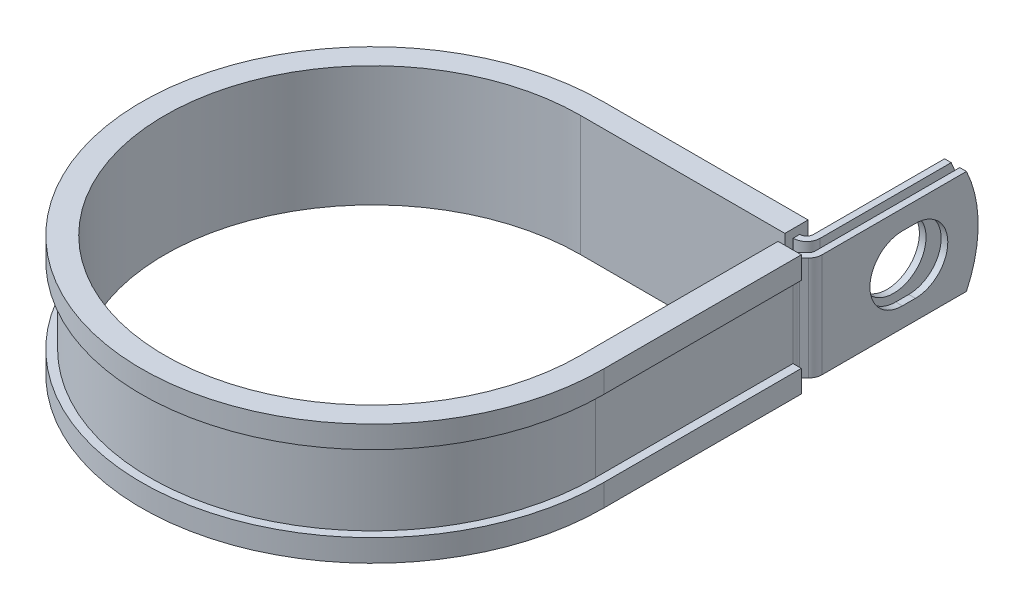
ISO-10303-21;
HEADER;
FILE_DESCRIPTION(('STEP AP214'),'2;1');
FILE_NAME('part.step','',(''),(''),'','','');
FILE_SCHEMA(('AUTOMOTIVE_DESIGN { 1 0 10303 214 1 1 1 1 }'));
ENDSEC;
DATA;
#1=APPLICATION_CONTEXT('core data for automotive mechanical design processes');
#2=APPLICATION_PROTOCOL_DEFINITION('international standard','automotive_design',2000,#1);
#3=PRODUCT_CONTEXT('',#1,'mechanical');
#4=PRODUCT('Part','Part','',(#3));
#5=PRODUCT_RELATED_PRODUCT_CATEGORY('part','',(#4));
#6=PRODUCT_DEFINITION_FORMATION('','',#4);
#7=PRODUCT_DEFINITION_CONTEXT('part definition',#1,'design');
#8=PRODUCT_DEFINITION('design','',#6,#7);
#9=PRODUCT_DEFINITION_SHAPE('','',#8);
#10=(LENGTH_UNIT() NAMED_UNIT(*) SI_UNIT(.MILLI.,.METRE.));
#11=(NAMED_UNIT(*) PLANE_ANGLE_UNIT() SI_UNIT($,.RADIAN.));
#12=(NAMED_UNIT(*) SI_UNIT($,.STERADIAN.) SOLID_ANGLE_UNIT());
#13=UNCERTAINTY_MEASURE_WITH_UNIT(LENGTH_MEASURE(1.E-05),#10,'distance_accuracy_value','');
#14=(GEOMETRIC_REPRESENTATION_CONTEXT(3) GLOBAL_UNCERTAINTY_ASSIGNED_CONTEXT((#13)) GLOBAL_UNIT_ASSIGNED_CONTEXT((#10,
#11,#12)) REPRESENTATION_CONTEXT('',''));
#15=CARTESIAN_POINT('',(0.,0.,0.));
#16=DIRECTION('',(0.,0.,1.));
#17=DIRECTION('',(1.,0.,0.));
#18=AXIS2_PLACEMENT_3D('',#15,#16,#17);
#19=CARTESIAN_POINT('',(40.3022698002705,-9.525,-39.624));
#20=DIRECTION('',(0.,1.,0.));
#21=DIRECTION('',(1.,0.,0.));
#22=AXIS2_PLACEMENT_3D('',#19,#20,#21);
#23=PLANE('',#22);
#24=DIRECTION('',(0.,0.,-1.));
#25=VECTOR('',#24,1.);
#26=CARTESIAN_POINT('',(37.457469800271,-9.525,-39.624));
#27=LINE('',#26,#25);
#28=CARTESIAN_POINT('',(37.457469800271,-9.525,-39.624));
#29=VERTEX_POINT('',#28);
#30=CARTESIAN_POINT('',(37.457469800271,-9.525,-40.8432));
#31=VERTEX_POINT('',#30);
#32=EDGE_CURVE('E524',#29,#31,#27,.T.);
#33=ORIENTED_EDGE('',*,*,#32,.T.);
#34=DIRECTION('',(1.,0.,0.));
#35=VECTOR('',#34,1.);
#36=CARTESIAN_POINT('',(0.,-9.525,-40.8432));
#37=LINE('',#36,#35);
#38=CARTESIAN_POINT('',(37.5082698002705,-9.525,-40.8432));
#39=VERTEX_POINT('',#38);
#40=EDGE_CURVE('E411',#39,#31,#37,.F.);
#41=ORIENTED_EDGE('',*,*,#40,.F.);
#42=CARTESIAN_POINT('',(37.5082698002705,-9.525,-42.0624));
#43=DIRECTION('',(0.,1.,0.));
#44=DIRECTION('',(1.,0.,0.));
#45=AXIS2_PLACEMENT_3D('',#42,#43,#44);
#46=CIRCLE('',#45,1.21919999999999);
#47=CARTESIAN_POINT('',(38.7274698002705,-9.525,-42.0624));
#48=VERTEX_POINT('',#47);
#49=EDGE_CURVE('E409',#48,#39,#46,.F.);
#50=ORIENTED_EDGE('',*,*,#49,.F.);
#51=DIRECTION('',(0.,0.,1.));
#52=VECTOR('',#51,1.);
#53=CARTESIAN_POINT('',(38.7274698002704,-9.525,-68.2498));
#54=LINE('',#53,#52);
#55=CARTESIAN_POINT('',(38.7274698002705,-9.525,-66.1052631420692));
#56=VERTEX_POINT('',#55);
#57=EDGE_CURVE('E407',#56,#48,#54,.T.);
#58=ORIENTED_EDGE('',*,*,#57,.F.);
#59=DIRECTION('',(-1.,0.,0.));
#60=VECTOR('',#59,1.);
#61=CARTESIAN_POINT('',(42.7406698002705,-9.525,-66.1052631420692));
#62=LINE('',#61,#60);
#63=CARTESIAN_POINT('',(39.9466698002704,-9.525,-66.1052631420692));
#64=VERTEX_POINT('',#63);
#65=EDGE_CURVE('E12',#64,#56,#62,.T.);
#66=ORIENTED_EDGE('',*,*,#65,.F.);
#67=DIRECTION('',(0.,0.,1.));
#68=VECTOR('',#67,1.);
#69=CARTESIAN_POINT('',(39.9466698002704,-9.525,-68.2498));
#70=LINE('',#69,#68);
#71=CARTESIAN_POINT('',(39.9466698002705,-9.525,-42.0624));
#72=VERTEX_POINT('',#71);
#73=EDGE_CURVE('E405',#64,#72,#70,.T.);
#74=ORIENTED_EDGE('',*,*,#73,.T.);
#75=CARTESIAN_POINT('',(37.5082698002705,-9.525,-42.0624));
#76=DIRECTION('',(0.,-1.,0.));
#77=DIRECTION('',(0.,0.,1.));
#78=AXIS2_PLACEMENT_3D('',#75,#76,#77);
#79=CIRCLE('',#78,2.43839999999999);
#80=CARTESIAN_POINT('',(37.5082698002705,-9.525,-39.624));
#81=VERTEX_POINT('',#80);
#82=EDGE_CURVE('E402',#72,#81,#79,.T.);
#83=ORIENTED_EDGE('',*,*,#82,.T.);
#84=DIRECTION('',(-1.,0.,0.));
#85=VECTOR('',#84,1.);
#86=CARTESIAN_POINT('',(0.,-9.525,-39.624));
#87=LINE('',#86,#85);
#88=EDGE_CURVE('E399',#81,#29,#87,.T.);
#89=ORIENTED_EDGE('',*,*,#88,.T.);
#90=EDGE_LOOP('',(#33,#41,#50,#58,#66,#74,#83,#89));
#91=FACE_BOUND('',#90,.T.);
#92=ADVANCED_FACE('F55',(#91),#23,.F.);
#93=CARTESIAN_POINT('',(40.3022698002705,9.525,-39.624));
#94=DIRECTION('',(0.,1.,0.));
#95=DIRECTION('',(1.,0.,0.));
#96=AXIS2_PLACEMENT_3D('',#93,#94,#95);
#97=PLANE('',#96);
#98=DIRECTION('',(1.,0.,0.));
#99=VECTOR('',#98,1.);
#100=CARTESIAN_POINT('',(0.,9.525,-40.8432));
#101=LINE('',#100,#99);
#102=CARTESIAN_POINT('',(37.5082698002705,9.525,-40.8432));
#103=VERTEX_POINT('',#102);
#104=CARTESIAN_POINT('',(37.457469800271,9.525,-40.8432));
#105=VERTEX_POINT('',#104);
#106=EDGE_CURVE('E369',#103,#105,#101,.F.);
#107=ORIENTED_EDGE('',*,*,#106,.T.);
#108=DIRECTION('',(0.,0.,1.));
#109=VECTOR('',#108,1.);
#110=CARTESIAN_POINT('',(37.457469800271,9.525,-40.8432));
#111=LINE('',#110,#109);
#112=CARTESIAN_POINT('',(37.457469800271,9.525,-39.624));
#113=VERTEX_POINT('',#112);
#114=EDGE_CURVE('E518',#105,#113,#111,.T.);
#115=ORIENTED_EDGE('',*,*,#114,.T.);
#116=DIRECTION('',(-1.,0.,0.));
#117=VECTOR('',#116,1.);
#118=CARTESIAN_POINT('',(0.,9.525,-39.624));
#119=LINE('',#118,#117);
#120=CARTESIAN_POINT('',(37.5082698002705,9.525,-39.624));
#121=VERTEX_POINT('',#120);
#122=EDGE_CURVE('E626',#121,#113,#119,.T.);
#123=ORIENTED_EDGE('',*,*,#122,.F.);
#124=CARTESIAN_POINT('',(37.5082698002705,9.525,-42.0624));
#125=DIRECTION('',(0.,-1.,0.));
#126=DIRECTION('',(0.,0.,1.));
#127=AXIS2_PLACEMENT_3D('',#124,#125,#126);
#128=CIRCLE('',#127,2.43839999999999);
#129=CARTESIAN_POINT('',(39.9466698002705,9.525,-42.0624));
#130=VERTEX_POINT('',#129);
#131=EDGE_CURVE('E371',#130,#121,#128,.T.);
#132=ORIENTED_EDGE('',*,*,#131,.F.);
#133=DIRECTION('',(0.,0.,1.));
#134=VECTOR('',#133,1.);
#135=CARTESIAN_POINT('',(39.9466698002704,9.525,-68.2498));
#136=LINE('',#135,#134);
#137=CARTESIAN_POINT('',(39.9466698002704,9.525,-66.1052631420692));
#138=VERTEX_POINT('',#137);
#139=EDGE_CURVE('E362',#138,#130,#136,.T.);
#140=ORIENTED_EDGE('',*,*,#139,.F.);
#141=DIRECTION('',(-1.,0.,0.));
#142=VECTOR('',#141,1.);
#143=CARTESIAN_POINT('',(42.7406698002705,9.525,-66.1052631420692));
#144=LINE('',#143,#142);
#145=CARTESIAN_POINT('',(38.7274698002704,9.525,-66.1052631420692));
#146=VERTEX_POINT('',#145);
#147=EDGE_CURVE('E63',#138,#146,#144,.T.);
#148=ORIENTED_EDGE('',*,*,#147,.T.);
#149=DIRECTION('',(0.,0.,1.));
#150=VECTOR('',#149,1.);
#151=CARTESIAN_POINT('',(38.7274698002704,9.525,-68.2498));
#152=LINE('',#151,#150);
#153=CARTESIAN_POINT('',(38.7274698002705,9.525,-42.0624));
#154=VERTEX_POINT('',#153);
#155=EDGE_CURVE('E359',#146,#154,#152,.T.);
#156=ORIENTED_EDGE('',*,*,#155,.T.);
#157=CARTESIAN_POINT('',(37.5082698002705,9.525,-42.0624));
#158=DIRECTION('',(0.,1.,0.));
#159=DIRECTION('',(1.,0.,0.));
#160=AXIS2_PLACEMENT_3D('',#157,#158,#159);
#161=CIRCLE('',#160,1.21919999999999);
#162=EDGE_CURVE('E367',#154,#103,#161,.F.);
#163=ORIENTED_EDGE('',*,*,#162,.T.);
#164=EDGE_LOOP('',(#107,#115,#123,#132,#140,#148,#156,#163));
#165=FACE_BOUND('',#164,.T.);
#166=ADVANCED_FACE('F358',(#165),#97,.T.);
#167=CARTESIAN_POINT('',(0.,9.525,-39.624));
#168=DIRECTION('',(0.,0.,1.));
#169=DIRECTION('',(1.,0.,0.));
#170=AXIS2_PLACEMENT_3D('',#167,#168,#169);
#171=PLANE('',#170);
#172=ORIENTED_EDGE('',*,*,#122,.T.);
#173=DIRECTION('',(0.,-1.,0.));
#174=VECTOR('',#173,1.);
#175=CARTESIAN_POINT('',(37.457469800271,9.525,-39.624));
#176=LINE('',#175,#174);
#177=EDGE_CURVE('E521',#113,#29,#176,.T.);
#178=ORIENTED_EDGE('',*,*,#177,.T.);
#179=ORIENTED_EDGE('',*,*,#88,.F.);
#180=DIRECTION('',(0.,-1.,0.));
#181=VECTOR('',#180,1.);
#182=CARTESIAN_POINT('',(37.5082698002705,9.525,-39.624));
#183=LINE('',#182,#181);
#184=EDGE_CURVE('E345',#121,#81,#183,.T.);
#185=ORIENTED_EDGE('',*,*,#184,.F.);
#186=EDGE_LOOP('',(#172,#178,#179,#185));
#187=FACE_BOUND('',#186,.T.);
#188=ADVANCED_FACE('F636',(#187),#171,.T.);
#189=CARTESIAN_POINT('',(42.7406698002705,9.525,-39.624));
#190=DIRECTION('',(-1.,0.,0.));
#191=DIRECTION('',(0.,0.,1.));
#192=AXIS2_PLACEMENT_3D('',#189,#190,#191);
#193=PLANE('',#192);
#194=CARTESIAN_POINT('',(42.7406698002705,0.,-56.7435999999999));
#195=DIRECTION('',(1.,0.,0.));
#196=DIRECTION('',(0.,0.,-1.));
#197=AXIS2_PLACEMENT_3D('',#194,#195,#196);
#198=CIRCLE('',#197,5.9436);
#199=CARTESIAN_POINT('',(42.7406698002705,-5.9436,-56.7436000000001));
#200=VERTEX_POINT('',#199);
#201=CARTESIAN_POINT('',(42.7406698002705,5.9436,-56.7436000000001));
#202=VERTEX_POINT('',#201);
#203=EDGE_CURVE('E581',#200,#202,#198,.T.);
#204=ORIENTED_EDGE('',*,*,#203,.F.);
#205=DIRECTION('',(0.,0.,-1.));
#206=VECTOR('',#205,1.);
#207=CARTESIAN_POINT('',(42.7406698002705,-5.9436,-54.3559999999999));
#208=LINE('',#207,#206);
#209=CARTESIAN_POINT('',(42.7406698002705,-5.9436,-54.3559999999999));
#210=VERTEX_POINT('',#209);
#211=EDGE_CURVE('E584',#210,#200,#208,.T.);
#212=ORIENTED_EDGE('',*,*,#211,.F.);
#213=CARTESIAN_POINT('',(42.7406698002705,0.,-54.3559999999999));
#214=DIRECTION('',(1.,0.,0.));
#215=DIRECTION('',(0.,0.,-1.));
#216=AXIS2_PLACEMENT_3D('',#213,#214,#215);
#217=CIRCLE('',#216,5.9436);
#218=CARTESIAN_POINT('',(42.7406698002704,5.9436,-54.3559999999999));
#219=VERTEX_POINT('',#218);
#220=EDGE_CURVE('E577',#219,#210,#217,.T.);
#221=ORIENTED_EDGE('',*,*,#220,.F.);
#222=DIRECTION('',(0.,0.,1.));
#223=VECTOR('',#222,1.);
#224=CARTESIAN_POINT('',(42.7406698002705,5.9436,-54.3559999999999));
#225=LINE('',#224,#223);
#226=EDGE_CURVE('E578',#202,#219,#225,.T.);
#227=ORIENTED_EDGE('',*,*,#226,.F.);
#228=EDGE_LOOP('',(#204,#212,#221,#227));
#229=FACE_BOUND('',#228,.T.);
#230=DIRECTION('',(0.,0.,-1.));
#231=VECTOR('',#230,1.);
#232=CARTESIAN_POINT('',(42.7406698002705,-9.525,-39.624));
#233=LINE('',#232,#231);
#234=CARTESIAN_POINT('',(42.7406698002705,-9.525,-39.624));
#235=VERTEX_POINT('',#234);
#236=CARTESIAN_POINT('',(42.7406698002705,-9.525,-66.1052631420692));
#237=VERTEX_POINT('',#236);
#238=EDGE_CURVE('E383',#235,#237,#233,.T.);
#239=ORIENTED_EDGE('',*,*,#238,.T.);
#240=CARTESIAN_POINT('',(42.7406698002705,0.,-46.0248));
#241=DIRECTION('',(-1.,0.,0.));
#242=DIRECTION('',(0.,0.,1.));
#243=AXIS2_PLACEMENT_3D('',#240,#241,#242);
#244=CIRCLE('',#243,22.225);
#245=CARTESIAN_POINT('',(42.7406698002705,9.525,-66.1052631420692));
#246=VERTEX_POINT('',#245);
#247=EDGE_CURVE('E569',#246,#237,#244,.T.);
#248=ORIENTED_EDGE('',*,*,#247,.F.);
#249=DIRECTION('',(0.,0.,-1.));
#250=VECTOR('',#249,1.);
#251=CARTESIAN_POINT('',(42.7406698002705,9.525,-39.624));
#252=LINE('',#251,#250);
#253=CARTESIAN_POINT('',(42.7406698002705,9.525,-39.624));
#254=VERTEX_POINT('',#253);
#255=EDGE_CURVE('E420',#254,#246,#252,.T.);
#256=ORIENTED_EDGE('',*,*,#255,.F.);
#257=DIRECTION('',(0.,-1.,0.));
#258=VECTOR('',#257,1.);
#259=CARTESIAN_POINT('',(42.7406698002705,9.525,-39.624));
#260=LINE('',#259,#258);
#261=EDGE_CURVE('E382',#254,#235,#260,.T.);
#262=ORIENTED_EDGE('',*,*,#261,.T.);
#263=EDGE_LOOP('',(#239,#248,#256,#262));
#264=FACE_BOUND('',#263,.T.);
#265=ADVANCED_FACE('F57',(#229,#264),#193,.F.);
#266=CARTESIAN_POINT('',(41.5214698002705,9.525,-39.624));
#267=DIRECTION('',(-1.,0.,0.));
#268=DIRECTION('',(0.,0.,1.));
#269=AXIS2_PLACEMENT_3D('',#266,#267,#268);
#270=PLANE('',#269);
#271=DIRECTION('',(0.,0.,-1.));
#272=VECTOR('',#271,1.);
#273=CARTESIAN_POINT('',(41.5214698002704,-5.9436,-54.3559999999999));
#274=LINE('',#273,#272);
#275=CARTESIAN_POINT('',(41.5214698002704,-5.9436,-54.3559999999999));
#276=VERTEX_POINT('',#275);
#277=CARTESIAN_POINT('',(41.5214698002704,-5.9436,-56.7436000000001));
#278=VERTEX_POINT('',#277);
#279=EDGE_CURVE('E580',#276,#278,#274,.T.);
#280=ORIENTED_EDGE('',*,*,#279,.T.);
#281=CARTESIAN_POINT('',(41.5214698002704,0.,-56.7435999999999));
#282=DIRECTION('',(-1.,0.,0.));
#283=DIRECTION('',(0.,0.,1.));
#284=AXIS2_PLACEMENT_3D('',#281,#282,#283);
#285=CIRCLE('',#284,5.9436);
#286=CARTESIAN_POINT('',(41.5214698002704,5.9436,-56.7436000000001));
#287=VERTEX_POINT('',#286);
#288=EDGE_CURVE('E601',#278,#287,#285,.F.);
#289=ORIENTED_EDGE('',*,*,#288,.T.);
#290=DIRECTION('',(0.,0.,1.));
#291=VECTOR('',#290,1.);
#292=CARTESIAN_POINT('',(41.5214698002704,5.9436,-54.3559999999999));
#293=LINE('',#292,#291);
#294=CARTESIAN_POINT('',(41.5214698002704,5.9436,-54.3559999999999));
#295=VERTEX_POINT('',#294);
#296=EDGE_CURVE('E597',#287,#295,#293,.T.);
#297=ORIENTED_EDGE('',*,*,#296,.T.);
#298=CARTESIAN_POINT('',(41.5214698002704,0.,-54.3559999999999));
#299=DIRECTION('',(-1.,0.,0.));
#300=DIRECTION('',(0.,0.,1.));
#301=AXIS2_PLACEMENT_3D('',#298,#299,#300);
#302=CIRCLE('',#301,5.9436);
#303=EDGE_CURVE('E592',#295,#276,#302,.F.);
#304=ORIENTED_EDGE('',*,*,#303,.T.);
#305=EDGE_LOOP('',(#280,#289,#297,#304));
#306=FACE_BOUND('',#305,.T.);
#307=CARTESIAN_POINT('',(41.5214698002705,0.,-46.0248));
#308=DIRECTION('',(-1.,0.,0.));
#309=DIRECTION('',(0.,0.,1.));
#310=AXIS2_PLACEMENT_3D('',#307,#308,#309);
#311=CIRCLE('',#310,22.225);
#312=CARTESIAN_POINT('',(41.5214698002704,9.525,-66.1052631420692));
#313=VERTEX_POINT('',#312);
#314=CARTESIAN_POINT('',(41.5214698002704,-9.525,-66.1052631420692));
#315=VERTEX_POINT('',#314);
#316=EDGE_CURVE('E77',#313,#315,#311,.T.);
#317=ORIENTED_EDGE('',*,*,#316,.T.);
#318=DIRECTION('',(0.,0.,-1.));
#319=VECTOR('',#318,1.);
#320=CARTESIAN_POINT('',(41.5214698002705,-9.525,-39.624));
#321=LINE('',#320,#319);
#322=CARTESIAN_POINT('',(41.5214698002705,-9.525,-39.624));
#323=VERTEX_POINT('',#322);
#324=EDGE_CURVE('E386',#323,#315,#321,.T.);
#325=ORIENTED_EDGE('',*,*,#324,.F.);
#326=DIRECTION('',(0.,-1.,0.));
#327=VECTOR('',#326,1.);
#328=CARTESIAN_POINT('',(41.5214698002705,9.525,-39.624));
#329=LINE('',#328,#327);
#330=CARTESIAN_POINT('',(41.5214698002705,9.525,-39.624));
#331=VERTEX_POINT('',#330);
#332=EDGE_CURVE('E353',#331,#323,#329,.T.);
#333=ORIENTED_EDGE('',*,*,#332,.F.);
#334=DIRECTION('',(0.,0.,-1.));
#335=VECTOR('',#334,1.);
#336=CARTESIAN_POINT('',(41.5214698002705,9.525,-39.624));
#337=LINE('',#336,#335);
#338=EDGE_CURVE('E616',#331,#313,#337,.T.);
#339=ORIENTED_EDGE('',*,*,#338,.T.);
#340=EDGE_LOOP('',(#317,#325,#333,#339));
#341=FACE_BOUND('',#340,.T.);
#342=ADVANCED_FACE('F690',(#306,#341),#270,.T.);
#343=CARTESIAN_POINT('',(39.9466698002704,9.525,-68.2498));
#344=DIRECTION('',(1.,0.,0.));
#345=DIRECTION('',(0.,0.,-1.));
#346=AXIS2_PLACEMENT_3D('',#343,#344,#345);
#347=PLANE('',#346);
#348=CARTESIAN_POINT('',(39.9466698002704,0.,-55.5498));
#349=DIRECTION('',(1.,0.,0.));
#350=DIRECTION('',(0.,0.,-1.));
#351=AXIS2_PLACEMENT_3D('',#348,#349,#350);
#352=CIRCLE('',#351,5.9436);
#353=CARTESIAN_POINT('',(39.9466698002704,0.,-61.4934));
#354=VERTEX_POINT('',#353);
#355=EDGE_CURVE('E387',#354,#354,#352,.F.);
#356=ORIENTED_EDGE('',*,*,#355,.T.);
#357=EDGE_LOOP('',(#356));
#358=FACE_BOUND('',#357,.T.);
#359=ORIENTED_EDGE('',*,*,#73,.F.);
#360=CARTESIAN_POINT('',(39.9466698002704,0.,-46.0248));
#361=DIRECTION('',(1.,0.,0.));
#362=DIRECTION('',(0.,0.,-1.));
#363=AXIS2_PLACEMENT_3D('',#360,#361,#362);
#364=CIRCLE('',#363,22.225);
#365=EDGE_CURVE('E574',#64,#138,#364,.T.);
#366=ORIENTED_EDGE('',*,*,#365,.T.);
#367=ORIENTED_EDGE('',*,*,#139,.T.);
#368=DIRECTION('',(0.,-1.,0.));
#369=VECTOR('',#368,1.);
#370=CARTESIAN_POINT('',(39.9466698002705,9.525,-42.0624));
#371=LINE('',#370,#369);
#372=EDGE_CURVE('E342',#130,#72,#371,.T.);
#373=ORIENTED_EDGE('',*,*,#372,.T.);
#374=EDGE_LOOP('',(#359,#366,#367,#373));
#375=FACE_BOUND('',#374,.T.);
#376=ADVANCED_FACE('F642',(#358,#375),#347,.T.);
#377=CARTESIAN_POINT('',(38.7274698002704,9.525,-68.2498));
#378=DIRECTION('',(1.,0.,0.));
#379=DIRECTION('',(0.,0.,-1.));
#380=AXIS2_PLACEMENT_3D('',#377,#378,#379);
#381=PLANE('',#380);
#382=CARTESIAN_POINT('',(38.7274698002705,0.,-55.5498));
#383=DIRECTION('',(-1.,0.,0.));
#384=DIRECTION('',(0.,0.,1.));
#385=AXIS2_PLACEMENT_3D('',#382,#383,#384);
#386=CIRCLE('',#385,5.9436);
#387=CARTESIAN_POINT('',(38.7274698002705,0.,-49.6062));
#388=VERTEX_POINT('',#387);
#389=EDGE_CURVE('E609',#388,#388,#386,.T.);
#390=ORIENTED_EDGE('',*,*,#389,.F.);
#391=EDGE_LOOP('',(#390));
#392=FACE_BOUND('',#391,.T.);
#393=CARTESIAN_POINT('',(38.7274698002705,0.,-46.0248));
#394=DIRECTION('',(-1.,0.,0.));
#395=DIRECTION('',(0.,0.,1.));
#396=AXIS2_PLACEMENT_3D('',#393,#394,#395);
#397=CIRCLE('',#396,22.225);
#398=EDGE_CURVE('E69',#146,#56,#397,.T.);
#399=ORIENTED_EDGE('',*,*,#398,.T.);
#400=ORIENTED_EDGE('',*,*,#57,.T.);
#401=DIRECTION('',(0.,-1.,0.));
#402=VECTOR('',#401,1.);
#403=CARTESIAN_POINT('',(38.7274698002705,9.525,-42.0624));
#404=LINE('',#403,#402);
#405=EDGE_CURVE('E339',#154,#48,#404,.T.);
#406=ORIENTED_EDGE('',*,*,#405,.F.);
#407=ORIENTED_EDGE('',*,*,#155,.F.);
#408=EDGE_LOOP('',(#399,#400,#406,#407));
#409=FACE_BOUND('',#408,.T.);
#410=ADVANCED_FACE('F365',(#392,#409),#381,.F.);
#411=CARTESIAN_POINT('',(42.0624,-9.525,-36.2115026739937));
#412=DIRECTION('',(0.,1.,0.));
#413=DIRECTION('',(1.,0.,0.));
#414=AXIS2_PLACEMENT_3D('',#411,#412,#413);
#415=CIRCLE('',#414,1.2192);
#416=CARTESIAN_POINT('',(40.8432,-9.525,-36.2115026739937));
#417=VERTEX_POINT('',#416);
#418=CARTESIAN_POINT('',(41.2002954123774,-9.525,-37.0736072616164));
#419=VERTEX_POINT('',#418);
#420=EDGE_CURVE('E414',#417,#419,#415,.F.);
#421=ORIENTED_EDGE('',*,*,#420,.F.);
#422=DIRECTION('',(1.,0.,0.));
#423=VECTOR('',#422,1.);
#424=CARTESIAN_POINT('',(39.624,-9.525,-36.2115026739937));
#425=LINE('',#424,#423);
#426=CARTESIAN_POINT('',(39.624,-9.525,-36.2115026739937));
#427=VERTEX_POINT('',#426);
#428=EDGE_CURVE('E452',#427,#417,#425,.T.);
#429=ORIENTED_EDGE('',*,*,#428,.F.);
#430=CARTESIAN_POINT('',(42.0624,-9.525,-36.2115026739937));
#431=DIRECTION('',(0.,-1.,0.));
#432=DIRECTION('',(0.,0.,1.));
#433=AXIS2_PLACEMENT_3D('',#430,#431,#432);
#434=CIRCLE('',#433,2.4384);
#435=CARTESIAN_POINT('',(40.3381908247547,-9.525,-37.935711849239));
#436=VERTEX_POINT('',#435);
#437=EDGE_CURVE('E396',#427,#436,#434,.T.);
#438=ORIENTED_EDGE('',*,*,#437,.T.);
#439=DIRECTION('',(0.707106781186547,0.,-0.707106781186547));
#440=VECTOR('',#439,1.);
#441=CARTESIAN_POINT('',(40.3381908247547,-9.525,-37.935711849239));
#442=LINE('',#441,#440);
#443=CARTESIAN_POINT('',(41.1643743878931,-9.525,-38.7618954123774));
#444=VERTEX_POINT('',#443);
#445=EDGE_CURVE('E393',#436,#444,#442,.T.);
#446=ORIENTED_EDGE('',*,*,#445,.T.);
#447=CARTESIAN_POINT('',(40.3022698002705,-9.525,-39.624));
#448=DIRECTION('',(0.,1.,0.));
#449=DIRECTION('',(0.,0.,1.));
#450=AXIS2_PLACEMENT_3D('',#447,#448,#449);
#451=CIRCLE('',#450,1.2192);
#452=EDGE_CURVE('E390',#444,#323,#451,.T.);
#453=ORIENTED_EDGE('',*,*,#452,.T.);
#454=ORIENTED_EDGE('',*,*,#324,.T.);
#455=DIRECTION('',(-1.,0.,0.));
#456=VECTOR('',#455,1.);
#457=CARTESIAN_POINT('',(42.7406698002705,-9.525,-66.1052631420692));
#458=LINE('',#457,#456);
#459=EDGE_CURVE('E567',#237,#315,#458,.T.);
#460=ORIENTED_EDGE('',*,*,#459,.F.);
#461=ORIENTED_EDGE('',*,*,#238,.F.);
#462=CARTESIAN_POINT('',(40.3022698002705,-9.525,-39.624));
#463=DIRECTION('',(0.,1.,0.));
#464=DIRECTION('',(1.,0.,0.));
#465=AXIS2_PLACEMENT_3D('',#462,#463,#464);
#466=CIRCLE('',#465,2.4384);
#467=CARTESIAN_POINT('',(42.0264789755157,-9.525,-37.8997908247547));
#468=VERTEX_POINT('',#467);
#469=EDGE_CURVE('E418',#468,#235,#466,.T.);
#470=ORIENTED_EDGE('',*,*,#469,.F.);
#471=DIRECTION('',(0.707106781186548,0.,-0.707106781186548));
#472=VECTOR('',#471,1.);
#473=CARTESIAN_POINT('',(41.2002954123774,-9.525,-37.0736072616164));
#474=LINE('',#473,#472);
#475=EDGE_CURVE('E416',#419,#468,#474,.T.);
#476=ORIENTED_EDGE('',*,*,#475,.F.);
#477=EDGE_LOOP('',(#421,#429,#438,#446,#453,#454,#460,#461,#470,#476));
#478=FACE_BOUND('',#477,.T.);
#479=ADVANCED_FACE('F676',(#478),#23,.F.);
#480=DIRECTION('',(-1.,0.,0.));
#481=VECTOR('',#480,1.);
#482=CARTESIAN_POINT('',(40.8432,9.525,-36.2115026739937));
#483=LINE('',#482,#481);
#484=CARTESIAN_POINT('',(40.8432,9.525,-36.2115026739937));
#485=VERTEX_POINT('',#484);
#486=CARTESIAN_POINT('',(39.624,9.525,-36.2115026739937));
#487=VERTEX_POINT('',#486);
#488=EDGE_CURVE('E441',#485,#487,#483,.T.);
#489=ORIENTED_EDGE('',*,*,#488,.F.);
#490=CARTESIAN_POINT('',(42.0624,9.525,-36.2115026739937));
#491=DIRECTION('',(0.,1.,0.));
#492=DIRECTION('',(1.,0.,0.));
#493=AXIS2_PLACEMENT_3D('',#490,#491,#492);
#494=CIRCLE('',#493,1.2192);
#495=CARTESIAN_POINT('',(41.2002954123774,9.525,-37.0736072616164));
#496=VERTEX_POINT('',#495);
#497=EDGE_CURVE('E376',#485,#496,#494,.F.);
#498=ORIENTED_EDGE('',*,*,#497,.T.);
#499=DIRECTION('',(0.707106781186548,0.,-0.707106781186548));
#500=VECTOR('',#499,1.);
#501=CARTESIAN_POINT('',(41.2002954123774,9.525,-37.0736072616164));
#502=LINE('',#501,#500);
#503=CARTESIAN_POINT('',(42.0264789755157,9.525,-37.8997908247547));
#504=VERTEX_POINT('',#503);
#505=EDGE_CURVE('E378',#496,#504,#502,.T.);
#506=ORIENTED_EDGE('',*,*,#505,.T.);
#507=CARTESIAN_POINT('',(40.3022698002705,9.525,-39.624));
#508=DIRECTION('',(0.,1.,0.));
#509=DIRECTION('',(1.,0.,0.));
#510=AXIS2_PLACEMENT_3D('',#507,#508,#509);
#511=CIRCLE('',#510,2.4384);
#512=EDGE_CURVE('E380',#504,#254,#511,.T.);
#513=ORIENTED_EDGE('',*,*,#512,.T.);
#514=ORIENTED_EDGE('',*,*,#255,.T.);
#515=DIRECTION('',(-1.,0.,0.));
#516=VECTOR('',#515,1.);
#517=CARTESIAN_POINT('',(42.7406698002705,9.525,-66.1052631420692));
#518=LINE('',#517,#516);
#519=EDGE_CURVE('E571',#246,#313,#518,.T.);
#520=ORIENTED_EDGE('',*,*,#519,.T.);
#521=ORIENTED_EDGE('',*,*,#338,.F.);
#522=CARTESIAN_POINT('',(40.3022698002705,9.525,-39.624));
#523=DIRECTION('',(0.,1.,0.));
#524=DIRECTION('',(0.,0.,1.));
#525=AXIS2_PLACEMENT_3D('',#522,#523,#524);
#526=CIRCLE('',#525,1.2192);
#527=CARTESIAN_POINT('',(41.1643743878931,9.525,-38.7618954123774));
#528=VERTEX_POINT('',#527);
#529=EDGE_CURVE('E619',#528,#331,#526,.T.);
#530=ORIENTED_EDGE('',*,*,#529,.F.);
#531=DIRECTION('',(0.707106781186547,0.,-0.707106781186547));
#532=VECTOR('',#531,1.);
#533=CARTESIAN_POINT('',(40.3381908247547,9.525,-37.935711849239));
#534=LINE('',#533,#532);
#535=CARTESIAN_POINT('',(40.3381908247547,9.525,-37.935711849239));
#536=VERTEX_POINT('',#535);
#537=EDGE_CURVE('E622',#536,#528,#534,.T.);
#538=ORIENTED_EDGE('',*,*,#537,.F.);
#539=CARTESIAN_POINT('',(42.0624,9.525,-36.2115026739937));
#540=DIRECTION('',(0.,-1.,0.));
#541=DIRECTION('',(0.,0.,1.));
#542=AXIS2_PLACEMENT_3D('',#539,#540,#541);
#543=CIRCLE('',#542,2.4384);
#544=EDGE_CURVE('E451',#487,#536,#543,.T.);
#545=ORIENTED_EDGE('',*,*,#544,.F.);
#546=EDGE_LOOP('',(#489,#498,#506,#513,#514,#520,#521,#530,#538,#545));
#547=FACE_BOUND('',#546,.T.);
#548=ADVANCED_FACE('F448',(#547),#97,.T.);
#549=CARTESIAN_POINT('',(40.3022698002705,9.525,-39.624));
#550=DIRECTION('',(0.,-1.,0.));
#551=DIRECTION('',(0.,0.,-1.));
#552=AXIS2_PLACEMENT_3D('',#549,#550,#551);
#553=CYLINDRICAL_SURFACE('',#552,1.2192);
#554=ORIENTED_EDGE('',*,*,#452,.F.);
#555=DIRECTION('',(0.,-1.,0.));
#556=VECTOR('',#555,1.);
#557=CARTESIAN_POINT('',(41.1643743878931,9.525,-38.7618954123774));
#558=LINE('',#557,#556);
#559=EDGE_CURVE('E351',#528,#444,#558,.T.);
#560=ORIENTED_EDGE('',*,*,#559,.F.);
#561=ORIENTED_EDGE('',*,*,#529,.T.);
#562=ORIENTED_EDGE('',*,*,#332,.T.);
#563=EDGE_LOOP('',(#554,#560,#561,#562));
#564=FACE_BOUND('',#563,.T.);
#565=ADVANCED_FACE('F686',(#564),#553,.F.);
#566=CARTESIAN_POINT('',(40.3381908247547,9.525,-37.935711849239));
#567=DIRECTION('',(-0.707106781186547,0.,-0.707106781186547));
#568=DIRECTION('',(-0.707106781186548,0.,0.707106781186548));
#569=AXIS2_PLACEMENT_3D('',#566,#567,#568);
#570=PLANE('',#569);
#571=ORIENTED_EDGE('',*,*,#445,.F.);
#572=DIRECTION('',(0.,-1.,0.));
#573=VECTOR('',#572,1.);
#574=CARTESIAN_POINT('',(40.3381908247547,9.525,-37.935711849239));
#575=LINE('',#574,#573);
#576=EDGE_CURVE('E349',#536,#436,#575,.T.);
#577=ORIENTED_EDGE('',*,*,#576,.F.);
#578=ORIENTED_EDGE('',*,*,#537,.T.);
#579=ORIENTED_EDGE('',*,*,#559,.T.);
#580=EDGE_LOOP('',(#571,#577,#578,#579));
#581=FACE_BOUND('',#580,.T.);
#582=ADVANCED_FACE('F681',(#581),#570,.T.);
#583=CARTESIAN_POINT('',(42.0624,9.525,-36.2115026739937));
#584=DIRECTION('',(0.,-1.,0.));
#585=DIRECTION('',(0.,0.,-1.));
#586=AXIS2_PLACEMENT_3D('',#583,#584,#585);
#587=CYLINDRICAL_SURFACE('',#586,2.4384);
#588=ORIENTED_EDGE('',*,*,#437,.F.);
#589=DIRECTION('',(0.,-1.,0.));
#590=VECTOR('',#589,1.);
#591=CARTESIAN_POINT('',(39.624,9.525,-36.2115026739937));
#592=LINE('',#591,#590);
#593=EDGE_CURVE('E347',#487,#427,#592,.T.);
#594=ORIENTED_EDGE('',*,*,#593,.F.);
#595=ORIENTED_EDGE('',*,*,#544,.T.);
#596=ORIENTED_EDGE('',*,*,#576,.T.);
#597=EDGE_LOOP('',(#588,#594,#595,#596));
#598=FACE_BOUND('',#597,.T.);
#599=ADVANCED_FACE('F678',(#598),#587,.T.);
#600=CARTESIAN_POINT('',(37.5082698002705,9.525,-42.0624));
#601=DIRECTION('',(0.,-1.,0.));
#602=DIRECTION('',(0.,0.,-1.));
#603=AXIS2_PLACEMENT_3D('',#600,#601,#602);
#604=CYLINDRICAL_SURFACE('',#603,2.43839999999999);
#605=ORIENTED_EDGE('',*,*,#82,.F.);
#606=ORIENTED_EDGE('',*,*,#372,.F.);
#607=ORIENTED_EDGE('',*,*,#131,.T.);
#608=ORIENTED_EDGE('',*,*,#184,.T.);
#609=EDGE_LOOP('',(#605,#606,#607,#608));
#610=FACE_BOUND('',#609,.T.);
#611=ADVANCED_FACE('F632',(#610),#604,.T.);
#612=CARTESIAN_POINT('',(37.5082698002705,9.525,-42.0624));
#613=DIRECTION('',(0.,-1.,0.));
#614=DIRECTION('',(0.,0.,-1.));
#615=AXIS2_PLACEMENT_3D('',#612,#613,#614);
#616=CYLINDRICAL_SURFACE('',#615,1.21919999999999);
#617=ORIENTED_EDGE('',*,*,#49,.T.);
#618=DIRECTION('',(0.,-1.,0.));
#619=VECTOR('',#618,1.);
#620=CARTESIAN_POINT('',(37.5082698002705,9.525,-40.8432));
#621=LINE('',#620,#619);
#622=EDGE_CURVE('E330',#103,#39,#621,.T.);
#623=ORIENTED_EDGE('',*,*,#622,.F.);
#624=ORIENTED_EDGE('',*,*,#162,.F.);
#625=ORIENTED_EDGE('',*,*,#405,.T.);
#626=EDGE_LOOP('',(#617,#623,#624,#625));
#627=FACE_BOUND('',#626,.T.);
#628=ADVANCED_FACE('F647',(#627),#616,.F.);
#629=CARTESIAN_POINT('',(0.,9.525,-40.8432));
#630=DIRECTION('',(0.,0.,1.));
#631=DIRECTION('',(1.,0.,0.));
#632=AXIS2_PLACEMENT_3D('',#629,#630,#631);
#633=PLANE('',#632);
#634=DIRECTION('',(0.,-1.,0.));
#635=VECTOR('',#634,1.);
#636=CARTESIAN_POINT('',(0.,9.525,-40.8432));
#637=LINE('',#636,#635);
#638=CARTESIAN_POINT('',(5.72914007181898E-13,6.985,-40.8432));
#639=VERTEX_POINT('',#638);
#640=CARTESIAN_POINT('',(5.72914007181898E-13,-6.985,-40.8432));
#641=VERTEX_POINT('',#640);
#642=EDGE_CURVE('E321',#639,#641,#637,.T.);
#643=ORIENTED_EDGE('',*,*,#642,.F.);
#644=DIRECTION('',(1.,0.,0.));
#645=VECTOR('',#644,1.);
#646=CARTESIAN_POINT('',(5.72914007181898E-13,6.985,-40.8432));
#647=LINE('',#646,#645);
#648=CARTESIAN_POINT('',(37.457469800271,6.985,-40.8432));
#649=VERTEX_POINT('',#648);
#650=EDGE_CURVE('E564',#639,#649,#647,.T.);
#651=ORIENTED_EDGE('',*,*,#650,.T.);
#652=DIRECTION('',(0.,1.,0.));
#653=VECTOR('',#652,1.);
#654=CARTESIAN_POINT('',(37.457469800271,9.525,-40.8432));
#655=LINE('',#654,#653);
#656=EDGE_CURVE('E515',#649,#105,#655,.T.);
#657=ORIENTED_EDGE('',*,*,#656,.T.);
#658=ORIENTED_EDGE('',*,*,#106,.F.);
#659=ORIENTED_EDGE('',*,*,#622,.T.);
#660=ORIENTED_EDGE('',*,*,#40,.T.);
#661=DIRECTION('',(0.,1.,0.));
#662=VECTOR('',#661,1.);
#663=CARTESIAN_POINT('',(37.457469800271,-9.525,-40.8432));
#664=LINE('',#663,#662);
#665=CARTESIAN_POINT('',(37.457469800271,-6.985,-40.8432));
#666=VERTEX_POINT('',#665);
#667=EDGE_CURVE('E527',#31,#666,#664,.T.);
#668=ORIENTED_EDGE('',*,*,#667,.T.);
#669=DIRECTION('',(1.,0.,0.));
#670=VECTOR('',#669,1.);
#671=CARTESIAN_POINT('',(5.72914007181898E-13,-6.985,-40.8432));
#672=LINE('',#671,#670);
#673=EDGE_CURVE('E544',#641,#666,#672,.T.);
#674=ORIENTED_EDGE('',*,*,#673,.F.);
#675=EDGE_LOOP('',(#643,#651,#657,#658,#659,#660,#668,#674));
#676=FACE_BOUND('',#675,.T.);
#677=ADVANCED_FACE('F651',(#676),#633,.F.);
#678=CARTESIAN_POINT('',(0.,9.525,0.));
#679=DIRECTION('',(0.,-1.,0.));
#680=DIRECTION('',(0.,0.,-1.));
#681=AXIS2_PLACEMENT_3D('',#678,#679,#680);
#682=CYLINDRICAL_SURFACE('',#681,40.8432);
#683=DIRECTION('',(0.,-1.,0.));
#684=VECTOR('',#683,1.);
#685=CARTESIAN_POINT('',(40.8432,9.525,0.));
#686=LINE('',#685,#684);
#687=CARTESIAN_POINT('',(40.8432,6.985,0.));
#688=VERTEX_POINT('',#687);
#689=CARTESIAN_POINT('',(40.8432,-6.985,0.));
#690=VERTEX_POINT('',#689);
#691=EDGE_CURVE('E319',#688,#690,#686,.T.);
#692=ORIENTED_EDGE('',*,*,#691,.F.);
#693=CARTESIAN_POINT('',(0.,6.985,0.));
#694=DIRECTION('',(0.,-1.,0.));
#695=DIRECTION('',(0.,0.,-1.));
#696=AXIS2_PLACEMENT_3D('',#693,#694,#695);
#697=CIRCLE('',#696,40.8432);
#698=EDGE_CURVE('E513',#688,#639,#697,.T.);
#699=ORIENTED_EDGE('',*,*,#698,.T.);
#700=ORIENTED_EDGE('',*,*,#642,.T.);
#701=CARTESIAN_POINT('',(0.,-6.985,0.));
#702=DIRECTION('',(0.,-1.,0.));
#703=DIRECTION('',(0.,0.,-1.));
#704=AXIS2_PLACEMENT_3D('',#701,#702,#703);
#705=CIRCLE('',#704,40.8432);
#706=EDGE_CURVE('E302',#690,#641,#705,.T.);
#707=ORIENTED_EDGE('',*,*,#706,.F.);
#708=EDGE_LOOP('',(#692,#699,#700,#707));
#709=FACE_BOUND('',#708,.T.);
#710=ADVANCED_FACE('F317',(#709),#682,.T.);
#711=CARTESIAN_POINT('',(40.8432,9.525,0.));
#712=DIRECTION('',(-1.,0.,0.));
#713=DIRECTION('',(0.,0.,1.));
#714=AXIS2_PLACEMENT_3D('',#711,#712,#713);
#715=PLANE('',#714);
#716=DIRECTION('',(0.,-1.,0.));
#717=VECTOR('',#716,1.);
#718=CARTESIAN_POINT('',(40.8432,9.525,-36.2115026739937));
#719=LINE('',#718,#717);
#720=CARTESIAN_POINT('',(40.8432,6.985,-36.2115026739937));
#721=VERTEX_POINT('',#720);
#722=CARTESIAN_POINT('',(40.8432,-6.985,-36.2115026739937));
#723=VERTEX_POINT('',#722);
#724=EDGE_CURVE('E333',#721,#723,#719,.T.);
#725=ORIENTED_EDGE('',*,*,#724,.F.);
#726=DIRECTION('',(0.,0.,-1.));
#727=VECTOR('',#726,1.);
#728=CARTESIAN_POINT('',(40.8432,6.985,0.));
#729=LINE('',#728,#727);
#730=EDGE_CURVE('E327',#688,#721,#729,.T.);
#731=ORIENTED_EDGE('',*,*,#730,.F.);
#732=ORIENTED_EDGE('',*,*,#691,.T.);
#733=DIRECTION('',(0.,0.,-1.));
#734=VECTOR('',#733,1.);
#735=CARTESIAN_POINT('',(40.8432,-6.985,0.));
#736=LINE('',#735,#734);
#737=EDGE_CURVE('E298',#690,#723,#736,.T.);
#738=ORIENTED_EDGE('',*,*,#737,.T.);
#739=EDGE_LOOP('',(#725,#731,#732,#738));
#740=FACE_BOUND('',#739,.T.);
#741=ADVANCED_FACE('F326',(#740),#715,.F.);
#742=CARTESIAN_POINT('',(42.0624,9.525,-36.2115026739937));
#743=DIRECTION('',(0.,-1.,0.));
#744=DIRECTION('',(0.,0.,-1.));
#745=AXIS2_PLACEMENT_3D('',#742,#743,#744);
#746=CYLINDRICAL_SURFACE('',#745,1.2192);
#747=ORIENTED_EDGE('',*,*,#420,.T.);
#748=DIRECTION('',(0.,-1.,0.));
#749=VECTOR('',#748,1.);
#750=CARTESIAN_POINT('',(41.2002954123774,9.525,-37.0736072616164));
#751=LINE('',#750,#749);
#752=EDGE_CURVE('E425',#496,#419,#751,.T.);
#753=ORIENTED_EDGE('',*,*,#752,.F.);
#754=ORIENTED_EDGE('',*,*,#497,.F.);
#755=EDGE_CURVE('E328',#485,#721,#719,.T.);
#756=ORIENTED_EDGE('',*,*,#755,.T.);
#757=ORIENTED_EDGE('',*,*,#724,.T.);
#758=DIRECTION('',(0.,1.,0.));
#759=VECTOR('',#758,1.);
#760=CARTESIAN_POINT('',(40.8432,-9.525,-36.2115026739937));
#761=LINE('',#760,#759);
#762=EDGE_CURVE('E434',#417,#723,#761,.T.);
#763=ORIENTED_EDGE('',*,*,#762,.F.);
#764=EDGE_LOOP('',(#747,#753,#754,#756,#757,#763));
#765=FACE_BOUND('',#764,.T.);
#766=ADVANCED_FACE('F433',(#765),#746,.F.);
#767=CARTESIAN_POINT('',(41.2002954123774,9.525,-37.0736072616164));
#768=DIRECTION('',(-0.707106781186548,0.,-0.707106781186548));
#769=DIRECTION('',(-0.707106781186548,0.,0.707106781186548));
#770=AXIS2_PLACEMENT_3D('',#767,#768,#769);
#771=PLANE('',#770);
#772=ORIENTED_EDGE('',*,*,#475,.T.);
#773=DIRECTION('',(0.,-1.,0.));
#774=VECTOR('',#773,1.);
#775=CARTESIAN_POINT('',(42.0264789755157,9.525,-37.8997908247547));
#776=LINE('',#775,#774);
#777=EDGE_CURVE('E423',#504,#468,#776,.T.);
#778=ORIENTED_EDGE('',*,*,#777,.F.);
#779=ORIENTED_EDGE('',*,*,#505,.F.);
#780=ORIENTED_EDGE('',*,*,#752,.T.);
#781=EDGE_LOOP('',(#772,#778,#779,#780));
#782=FACE_BOUND('',#781,.T.);
#783=ADVANCED_FACE('F702',(#782),#771,.F.);
#784=CARTESIAN_POINT('',(40.3022698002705,9.525,-39.624));
#785=DIRECTION('',(0.,-1.,0.));
#786=DIRECTION('',(0.,0.,-1.));
#787=AXIS2_PLACEMENT_3D('',#784,#785,#786);
#788=CYLINDRICAL_SURFACE('',#787,2.4384);
#789=ORIENTED_EDGE('',*,*,#469,.T.);
#790=ORIENTED_EDGE('',*,*,#261,.F.);
#791=ORIENTED_EDGE('',*,*,#512,.F.);
#792=ORIENTED_EDGE('',*,*,#777,.T.);
#793=EDGE_LOOP('',(#789,#790,#791,#792));
#794=FACE_BOUND('',#793,.T.);
#795=ADVANCED_FACE('F700',(#794),#788,.T.);
#796=CARTESIAN_POINT('',(56.7577092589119,0.,-55.5498));
#797=DIRECTION('',(-1.,0.,0.));
#798=DIRECTION('',(0.,0.,1.));
#799=AXIS2_PLACEMENT_3D('',#796,#797,#798);
#800=CYLINDRICAL_SURFACE('',#799,5.9436);
#801=ORIENTED_EDGE('',*,*,#389,.T.);
#802=EDGE_LOOP('',(#801));
#803=FACE_BOUND('',#802,.T.);
#804=ORIENTED_EDGE('',*,*,#355,.F.);
#805=EDGE_LOOP('',(#804));
#806=FACE_BOUND('',#805,.T.);
#807=ADVANCED_FACE('F709',(#803,#806),#800,.F.);
#808=CARTESIAN_POINT('',(22.9452635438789,-5.9436,-54.3559999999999));
#809=DIRECTION('',(0.,-1.,0.));
#810=DIRECTION('',(0.,0.,-1.));
#811=AXIS2_PLACEMENT_3D('',#808,#809,#810);
#812=PLANE('',#811);
#813=DIRECTION('',(1.,0.,0.));
#814=VECTOR('',#813,1.);
#815=CARTESIAN_POINT('',(22.9452635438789,-5.9436,-54.3559999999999));
#816=LINE('',#815,#814);
#817=EDGE_CURVE('E595',#276,#210,#816,.T.);
#818=ORIENTED_EDGE('',*,*,#817,.T.);
#819=ORIENTED_EDGE('',*,*,#211,.T.);
#820=DIRECTION('',(1.,0.,0.));
#821=VECTOR('',#820,1.);
#822=CARTESIAN_POINT('',(22.9452635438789,-5.9436,-56.7436000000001));
#823=LINE('',#822,#821);
#824=EDGE_CURVE('E591',#278,#200,#823,.T.);
#825=ORIENTED_EDGE('',*,*,#824,.F.);
#826=ORIENTED_EDGE('',*,*,#279,.F.);
#827=EDGE_LOOP('',(#818,#819,#825,#826));
#828=FACE_BOUND('',#827,.T.);
#829=ADVANCED_FACE('F752',(#828),#812,.F.);
#830=CARTESIAN_POINT('',(22.9452635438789,0.,-56.7435999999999));
#831=DIRECTION('',(1.,0.,0.));
#832=DIRECTION('',(0.,0.,-1.));
#833=AXIS2_PLACEMENT_3D('',#830,#831,#832);
#834=CYLINDRICAL_SURFACE('',#833,5.9436);
#835=ORIENTED_EDGE('',*,*,#824,.T.);
#836=ORIENTED_EDGE('',*,*,#203,.T.);
#837=DIRECTION('',(1.,0.,0.));
#838=VECTOR('',#837,1.);
#839=CARTESIAN_POINT('',(22.9452635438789,5.9436,-56.7436000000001));
#840=LINE('',#839,#838);
#841=EDGE_CURVE('E600',#287,#202,#840,.T.);
#842=ORIENTED_EDGE('',*,*,#841,.F.);
#843=ORIENTED_EDGE('',*,*,#288,.F.);
#844=EDGE_LOOP('',(#835,#836,#842,#843));
#845=FACE_BOUND('',#844,.T.);
#846=ADVANCED_FACE('F756',(#845),#834,.F.);
#847=CARTESIAN_POINT('',(22.9452635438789,5.9436,-54.3559999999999));
#848=DIRECTION('',(0.,1.,0.));
#849=DIRECTION('',(0.,0.,1.));
#850=AXIS2_PLACEMENT_3D('',#847,#848,#849);
#851=PLANE('',#850);
#852=ORIENTED_EDGE('',*,*,#841,.T.);
#853=ORIENTED_EDGE('',*,*,#226,.T.);
#854=DIRECTION('',(1.,0.,0.));
#855=VECTOR('',#854,1.);
#856=CARTESIAN_POINT('',(22.9452635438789,5.9436,-54.3559999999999));
#857=LINE('',#856,#855);
#858=EDGE_CURVE('E596',#295,#219,#857,.T.);
#859=ORIENTED_EDGE('',*,*,#858,.F.);
#860=ORIENTED_EDGE('',*,*,#296,.F.);
#861=EDGE_LOOP('',(#852,#853,#859,#860));
#862=FACE_BOUND('',#861,.T.);
#863=ADVANCED_FACE('F760',(#862),#851,.F.);
#864=CARTESIAN_POINT('',(22.9452635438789,0.,-54.3559999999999));
#865=DIRECTION('',(1.,0.,0.));
#866=DIRECTION('',(0.,0.,-1.));
#867=AXIS2_PLACEMENT_3D('',#864,#865,#866);
#868=CYLINDRICAL_SURFACE('',#867,5.9436);
#869=ORIENTED_EDGE('',*,*,#858,.T.);
#870=ORIENTED_EDGE('',*,*,#220,.T.);
#871=ORIENTED_EDGE('',*,*,#817,.F.);
#872=ORIENTED_EDGE('',*,*,#303,.F.);
#873=EDGE_LOOP('',(#869,#870,#871,#872));
#874=FACE_BOUND('',#873,.T.);
#875=ADVANCED_FACE('F764',(#874),#868,.F.);
#876=CARTESIAN_POINT('',(42.7406698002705,0.,-46.0248));
#877=DIRECTION('',(-1.,0.,0.));
#878=DIRECTION('',(0.,0.,1.));
#879=AXIS2_PLACEMENT_3D('',#876,#877,#878);
#880=CYLINDRICAL_SURFACE('',#879,22.225);
#881=ORIENTED_EDGE('',*,*,#365,.F.);
#882=ORIENTED_EDGE('',*,*,#65,.T.);
#883=ORIENTED_EDGE('',*,*,#398,.F.);
#884=ORIENTED_EDGE('',*,*,#147,.F.);
#885=EDGE_LOOP('',(#881,#882,#883,#884));
#886=FACE_BOUND('',#885,.T.);
#887=ADVANCED_FACE('F643',(#886),#880,.T.);
#888=ORIENTED_EDGE('',*,*,#519,.F.);
#889=ORIENTED_EDGE('',*,*,#247,.T.);
#890=ORIENTED_EDGE('',*,*,#459,.T.);
#891=ORIENTED_EDGE('',*,*,#316,.F.);
#892=EDGE_LOOP('',(#888,#889,#890,#891));
#893=FACE_BOUND('',#892,.T.);
#894=ADVANCED_FACE('F691',(#893),#880,.T.);
#895=CARTESIAN_POINT('',(5.94291395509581E-13,11.049,-42.3672));
#896=DIRECTION('',(0.,0.,1.));
#897=DIRECTION('',(1.,0.,0.));
#898=AXIS2_PLACEMENT_3D('',#895,#896,#897);
#899=PLANE('',#898);
#900=DIRECTION('',(0.,-1.,0.));
#901=VECTOR('',#900,1.);
#902=CARTESIAN_POINT('',(5.94291395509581E-13,11.049,-42.3672));
#903=LINE('',#902,#901);
#904=CARTESIAN_POINT('',(5.94291395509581E-13,11.049,-42.3672));
#905=VERTEX_POINT('',#904);
#906=CARTESIAN_POINT('',(5.94291395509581E-13,6.985,-42.3672));
#907=VERTEX_POINT('',#906);
#908=EDGE_CURVE('E323',#905,#907,#903,.T.);
#909=ORIENTED_EDGE('',*,*,#908,.F.);
#910=DIRECTION('',(1.,0.,0.));
#911=VECTOR('',#910,1.);
#912=CARTESIAN_POINT('',(5.94291395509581E-13,11.049,-42.3672));
#913=LINE('',#912,#911);
#914=CARTESIAN_POINT('',(37.457469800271,11.049,-42.3672));
#915=VERTEX_POINT('',#914);
#916=EDGE_CURVE('E558',#905,#915,#913,.T.);
#917=ORIENTED_EDGE('',*,*,#916,.T.);
#918=DIRECTION('',(0.,-1.,0.));
#919=VECTOR('',#918,1.);
#920=CARTESIAN_POINT('',(37.457469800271,11.049,-42.3672));
#921=LINE('',#920,#919);
#922=CARTESIAN_POINT('',(37.457469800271,6.985,-42.3672));
#923=VERTEX_POINT('',#922);
#924=EDGE_CURVE('E540',#915,#923,#921,.T.);
#925=ORIENTED_EDGE('',*,*,#924,.T.);
#926=DIRECTION('',(1.,0.,0.));
#927=VECTOR('',#926,1.);
#928=CARTESIAN_POINT('',(5.94291395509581E-13,6.985,-42.3672));
#929=LINE('',#928,#927);
#930=EDGE_CURVE('E561',#907,#923,#929,.T.);
#931=ORIENTED_EDGE('',*,*,#930,.F.);
#932=EDGE_LOOP('',(#909,#917,#925,#931));
#933=FACE_BOUND('',#932,.T.);
#934=ADVANCED_FACE('F855',(#933),#899,.F.);
#935=CARTESIAN_POINT('',(5.34434708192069E-13,11.049,-38.1));
#936=DIRECTION('',(0.,0.,-1.));
#937=DIRECTION('',(-1.,0.,0.));
#938=AXIS2_PLACEMENT_3D('',#935,#936,#937);
#939=PLANE('',#938);
#940=DIRECTION('',(0.,1.,0.));
#941=VECTOR('',#940,1.);
#942=CARTESIAN_POINT('',(5.34434708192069E-13,11.049,-38.1));
#943=LINE('',#942,#941);
#944=CARTESIAN_POINT('',(5.34434708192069E-13,-11.049,-38.1));
#945=VERTEX_POINT('',#944);
#946=CARTESIAN_POINT('',(5.34434708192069E-13,11.049,-38.1));
#947=VERTEX_POINT('',#946);
#948=EDGE_CURVE('E491',#945,#947,#943,.T.);
#949=ORIENTED_EDGE('',*,*,#948,.F.);
#950=DIRECTION('',(1.,0.,0.));
#951=VECTOR('',#950,1.);
#952=CARTESIAN_POINT('',(5.34434708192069E-13,-11.049,-38.1));
#953=LINE('',#952,#951);
#954=CARTESIAN_POINT('',(37.457469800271,-11.049,-38.1));
#955=VERTEX_POINT('',#954);
#956=EDGE_CURVE('E552',#945,#955,#953,.T.);
#957=ORIENTED_EDGE('',*,*,#956,.T.);
#958=DIRECTION('',(0.,1.,0.));
#959=VECTOR('',#958,1.);
#960=CARTESIAN_POINT('',(37.457469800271,11.049,-38.1));
#961=LINE('',#960,#959);
#962=CARTESIAN_POINT('',(37.457469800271,11.049,-38.1));
#963=VERTEX_POINT('',#962);
#964=EDGE_CURVE('E536',#955,#963,#961,.T.);
#965=ORIENTED_EDGE('',*,*,#964,.T.);
#966=DIRECTION('',(1.,0.,0.));
#967=VECTOR('',#966,1.);
#968=CARTESIAN_POINT('',(5.34434708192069E-13,11.049,-38.1));
#969=LINE('',#968,#967);
#970=EDGE_CURVE('E555',#947,#963,#969,.T.);
#971=ORIENTED_EDGE('',*,*,#970,.F.);
#972=EDGE_LOOP('',(#949,#957,#965,#971));
#973=FACE_BOUND('',#972,.T.);
#974=ADVANCED_FACE('F941',(#973),#939,.F.);
#975=CARTESIAN_POINT('',(5.94291395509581E-13,-11.049,-42.3672));
#976=DIRECTION('',(0.,0.,1.));
#977=DIRECTION('',(1.,0.,0.));
#978=AXIS2_PLACEMENT_3D('',#975,#976,#977);
#979=PLANE('',#978);
#980=DIRECTION('',(0.,-1.,0.));
#981=VECTOR('',#980,1.);
#982=CARTESIAN_POINT('',(5.94291395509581E-13,-11.049,-42.3672));
#983=LINE('',#982,#981);
#984=CARTESIAN_POINT('',(5.94291395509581E-13,-6.985,-42.3672));
#985=VERTEX_POINT('',#984);
#986=CARTESIAN_POINT('',(5.94291395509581E-13,-11.049,-42.3672));
#987=VERTEX_POINT('',#986);
#988=EDGE_CURVE('E477',#985,#987,#983,.T.);
#989=ORIENTED_EDGE('',*,*,#988,.F.);
#990=DIRECTION('',(1.,0.,0.));
#991=VECTOR('',#990,1.);
#992=CARTESIAN_POINT('',(5.94291395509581E-13,-6.985,-42.3672));
#993=LINE('',#992,#991);
#994=CARTESIAN_POINT('',(37.457469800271,-6.985,-42.3672));
#995=VERTEX_POINT('',#994);
#996=EDGE_CURVE('E546',#985,#995,#993,.T.);
#997=ORIENTED_EDGE('',*,*,#996,.T.);
#998=DIRECTION('',(0.,-1.,0.));
#999=VECTOR('',#998,1.);
#1000=CARTESIAN_POINT('',(37.457469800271,-11.049,-42.3672));
#1001=LINE('',#1000,#999);
#1002=CARTESIAN_POINT('',(37.457469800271,-11.049,-42.3672));
#1003=VERTEX_POINT('',#1002);
#1004=EDGE_CURVE('E532',#995,#1003,#1001,.T.);
#1005=ORIENTED_EDGE('',*,*,#1004,.T.);
#1006=DIRECTION('',(1.,0.,0.));
#1007=VECTOR('',#1006,1.);
#1008=CARTESIAN_POINT('',(5.94291395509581E-13,-11.049,-42.3672));
#1009=LINE('',#1008,#1007);
#1010=EDGE_CURVE('E549',#987,#1003,#1009,.T.);
#1011=ORIENTED_EDGE('',*,*,#1010,.F.);
#1012=EDGE_LOOP('',(#989,#997,#1005,#1011));
#1013=FACE_BOUND('',#1012,.T.);
#1014=ADVANCED_FACE('F662',(#1013),#979,.F.);
#1015=CARTESIAN_POINT('',(0.,9.525,0.));
#1016=DIRECTION('',(0.,-1.,0.));
#1017=DIRECTION('',(0.,0.,-1.));
#1018=AXIS2_PLACEMENT_3D('',#1015,#1016,#1017);
#1019=CYLINDRICAL_SURFACE('',#1018,42.3672);
#1020=DIRECTION('',(0.,-1.,0.));
#1021=VECTOR('',#1020,1.);
#1022=CARTESIAN_POINT('',(42.3672,11.049,0.));
#1023=LINE('',#1022,#1021);
#1024=CARTESIAN_POINT('',(42.3672,11.049,0.));
#1025=VERTEX_POINT('',#1024);
#1026=CARTESIAN_POINT('',(42.3672,6.985,0.));
#1027=VERTEX_POINT('',#1026);
#1028=EDGE_CURVE('E312',#1025,#1027,#1023,.T.);
#1029=ORIENTED_EDGE('',*,*,#1028,.F.);
#1030=CARTESIAN_POINT('',(0.,11.049,0.));
#1031=DIRECTION('',(0.,-1.,0.));
#1032=DIRECTION('',(0.,0.,-1.));
#1033=AXIS2_PLACEMENT_3D('',#1030,#1031,#1032);
#1034=CIRCLE('',#1033,42.3672);
#1035=EDGE_CURVE('E507',#1025,#905,#1034,.T.);
#1036=ORIENTED_EDGE('',*,*,#1035,.T.);
#1037=ORIENTED_EDGE('',*,*,#908,.T.);
#1038=CARTESIAN_POINT('',(0.,6.985,0.));
#1039=DIRECTION('',(0.,-1.,0.));
#1040=DIRECTION('',(0.,0.,-1.));
#1041=AXIS2_PLACEMENT_3D('',#1038,#1039,#1040);
#1042=CIRCLE('',#1041,42.3672);
#1043=EDGE_CURVE('E510',#1027,#907,#1042,.T.);
#1044=ORIENTED_EDGE('',*,*,#1043,.F.);
#1045=EDGE_LOOP('',(#1029,#1036,#1037,#1044));
#1046=FACE_BOUND('',#1045,.T.);
#1047=ADVANCED_FACE('F961',(#1046),#1019,.T.);
#1048=CARTESIAN_POINT('',(0.,9.525,0.));
#1049=DIRECTION('',(0.,-1.,0.));
#1050=DIRECTION('',(0.,0.,-1.));
#1051=AXIS2_PLACEMENT_3D('',#1048,#1049,#1050);
#1052=CYLINDRICAL_SURFACE('',#1051,38.1);
#1053=DIRECTION('',(0.,1.,0.));
#1054=VECTOR('',#1053,1.);
#1055=CARTESIAN_POINT('',(38.1,11.049,0.));
#1056=LINE('',#1055,#1054);
#1057=CARTESIAN_POINT('',(38.1,-11.049,0.));
#1058=VERTEX_POINT('',#1057);
#1059=CARTESIAN_POINT('',(38.1,11.049,0.));
#1060=VERTEX_POINT('',#1059);
#1061=EDGE_CURVE('E1124',#1058,#1060,#1056,.T.);
#1062=ORIENTED_EDGE('',*,*,#1061,.F.);
#1063=CARTESIAN_POINT('',(0.,-11.049,0.));
#1064=DIRECTION('',(0.,-1.,0.));
#1065=DIRECTION('',(0.,0.,-1.));
#1066=AXIS2_PLACEMENT_3D('',#1063,#1064,#1065);
#1067=CIRCLE('',#1066,38.1);
#1068=EDGE_CURVE('E501',#1058,#945,#1067,.T.);
#1069=ORIENTED_EDGE('',*,*,#1068,.T.);
#1070=ORIENTED_EDGE('',*,*,#948,.T.);
#1071=CARTESIAN_POINT('',(0.,11.049,0.));
#1072=DIRECTION('',(0.,-1.,0.));
#1073=DIRECTION('',(0.,0.,-1.));
#1074=AXIS2_PLACEMENT_3D('',#1071,#1072,#1073);
#1075=CIRCLE('',#1074,38.1);
#1076=EDGE_CURVE('E504',#1060,#947,#1075,.T.);
#1077=ORIENTED_EDGE('',*,*,#1076,.F.);
#1078=EDGE_LOOP('',(#1062,#1069,#1070,#1077));
#1079=FACE_BOUND('',#1078,.T.);
#1080=ADVANCED_FACE('F971',(#1079),#1052,.F.);
#1081=CARTESIAN_POINT('',(0.,9.525,0.));
#1082=DIRECTION('',(0.,-1.,0.));
#1083=DIRECTION('',(0.,0.,-1.));
#1084=AXIS2_PLACEMENT_3D('',#1081,#1082,#1083);
#1085=CYLINDRICAL_SURFACE('',#1084,42.3672);
#1086=DIRECTION('',(0.,-1.,0.));
#1087=VECTOR('',#1086,1.);
#1088=CARTESIAN_POINT('',(42.3672,-11.049,0.));
#1089=LINE('',#1088,#1087);
#1090=CARTESIAN_POINT('',(42.3672,-6.985,0.));
#1091=VERTEX_POINT('',#1090);
#1092=CARTESIAN_POINT('',(42.3672,-11.049,0.));
#1093=VERTEX_POINT('',#1092);
#1094=EDGE_CURVE('E475',#1091,#1093,#1089,.T.);
#1095=ORIENTED_EDGE('',*,*,#1094,.F.);
#1096=CARTESIAN_POINT('',(0.,-6.985,0.));
#1097=DIRECTION('',(0.,-1.,0.));
#1098=DIRECTION('',(0.,0.,-1.));
#1099=AXIS2_PLACEMENT_3D('',#1096,#1097,#1098);
#1100=CIRCLE('',#1099,42.3672);
#1101=EDGE_CURVE('E322',#1091,#985,#1100,.T.);
#1102=ORIENTED_EDGE('',*,*,#1101,.T.);
#1103=ORIENTED_EDGE('',*,*,#988,.T.);
#1104=CARTESIAN_POINT('',(0.,-11.049,0.));
#1105=DIRECTION('',(0.,-1.,0.));
#1106=DIRECTION('',(0.,0.,-1.));
#1107=AXIS2_PLACEMENT_3D('',#1104,#1105,#1106);
#1108=CIRCLE('',#1107,42.3672);
#1109=EDGE_CURVE('E498',#1093,#987,#1108,.T.);
#1110=ORIENTED_EDGE('',*,*,#1109,.F.);
#1111=EDGE_LOOP('',(#1095,#1102,#1103,#1110));
#1112=FACE_BOUND('',#1111,.T.);
#1113=ADVANCED_FACE('F665',(#1112),#1085,.T.);
#1114=CARTESIAN_POINT('',(42.3672,6.985,0.));
#1115=DIRECTION('',(0.,-1.,0.));
#1116=DIRECTION('',(0.,0.,-1.));
#1117=AXIS2_PLACEMENT_3D('',#1114,#1115,#1116);
#1118=PLANE('',#1117);
#1119=DIRECTION('',(-1.,0.,0.));
#1120=VECTOR('',#1119,1.);
#1121=CARTESIAN_POINT('',(42.3672,6.985,-36.2115026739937));
#1122=LINE('',#1121,#1120);
#1123=CARTESIAN_POINT('',(42.3672,6.985,-36.2115026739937));
#1124=VERTEX_POINT('',#1123);
#1125=EDGE_CURVE('E445',#1124,#721,#1122,.T.);
#1126=ORIENTED_EDGE('',*,*,#1125,.F.);
#1127=DIRECTION('',(0.,0.,-1.));
#1128=VECTOR('',#1127,1.);
#1129=CARTESIAN_POINT('',(42.3672,6.985,0.));
#1130=LINE('',#1129,#1128);
#1131=EDGE_CURVE('E478',#1027,#1124,#1130,.T.);
#1132=ORIENTED_EDGE('',*,*,#1131,.F.);
#1133=ORIENTED_EDGE('',*,*,#1043,.T.);
#1134=ORIENTED_EDGE('',*,*,#930,.T.);
#1135=DIRECTION('',(0.,0.,1.));
#1136=VECTOR('',#1135,1.);
#1137=CARTESIAN_POINT('',(37.457469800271,6.985,-42.3672));
#1138=LINE('',#1137,#1136);
#1139=EDGE_CURVE('E542',#923,#649,#1138,.T.);
#1140=ORIENTED_EDGE('',*,*,#1139,.T.);
#1141=ORIENTED_EDGE('',*,*,#650,.F.);
#1142=ORIENTED_EDGE('',*,*,#698,.F.);
#1143=ORIENTED_EDGE('',*,*,#730,.T.);
#1144=EDGE_LOOP('',(#1126,#1132,#1133,#1134,#1140,#1141,#1142,#1143));
#1145=FACE_BOUND('',#1144,.T.);
#1146=ADVANCED_FACE('F992',(#1145),#1118,.T.);
#1147=CARTESIAN_POINT('',(42.3672,11.049,0.));
#1148=DIRECTION('',(1.,0.,0.));
#1149=DIRECTION('',(0.,0.,-1.));
#1150=AXIS2_PLACEMENT_3D('',#1147,#1148,#1149);
#1151=PLANE('',#1150);
#1152=DIRECTION('',(0.,-1.,0.));
#1153=VECTOR('',#1152,1.);
#1154=CARTESIAN_POINT('',(42.3672,11.049,-36.2115026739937));
#1155=LINE('',#1154,#1153);
#1156=CARTESIAN_POINT('',(42.3672,11.049,-36.2115026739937));
#1157=VERTEX_POINT('',#1156);
#1158=EDGE_CURVE('E472',#1157,#1124,#1155,.T.);
#1159=ORIENTED_EDGE('',*,*,#1158,.F.);
#1160=DIRECTION('',(0.,0.,-1.));
#1161=VECTOR('',#1160,1.);
#1162=CARTESIAN_POINT('',(42.3672,11.049,0.));
#1163=LINE('',#1162,#1161);
#1164=EDGE_CURVE('E480',#1025,#1157,#1163,.T.);
#1165=ORIENTED_EDGE('',*,*,#1164,.F.);
#1166=ORIENTED_EDGE('',*,*,#1028,.T.);
#1167=ORIENTED_EDGE('',*,*,#1131,.T.);
#1168=EDGE_LOOP('',(#1159,#1165,#1166,#1167));
#1169=FACE_BOUND('',#1168,.T.);
#1170=ADVANCED_FACE('F1003',(#1169),#1151,.T.);
#1171=CARTESIAN_POINT('',(42.3672,11.049,0.));
#1172=DIRECTION('',(0.,1.,0.));
#1173=DIRECTION('',(0.,0.,1.));
#1174=AXIS2_PLACEMENT_3D('',#1171,#1172,#1173);
#1175=PLANE('',#1174);
#1176=DIRECTION('',(1.,0.,0.));
#1177=VECTOR('',#1176,1.);
#1178=CARTESIAN_POINT('',(42.3672,11.049,-36.2115026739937));
#1179=LINE('',#1178,#1177);
#1180=CARTESIAN_POINT('',(38.1,11.049,-36.2115026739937));
#1181=VERTEX_POINT('',#1180);
#1182=EDGE_CURVE('E469',#1181,#1157,#1179,.T.);
#1183=ORIENTED_EDGE('',*,*,#1182,.F.);
#1184=DIRECTION('',(0.,0.,-1.));
#1185=VECTOR('',#1184,1.);
#1186=CARTESIAN_POINT('',(38.1,11.049,0.));
#1187=LINE('',#1186,#1185);
#1188=EDGE_CURVE('E482',#1060,#1181,#1187,.T.);
#1189=ORIENTED_EDGE('',*,*,#1188,.F.);
#1190=ORIENTED_EDGE('',*,*,#1076,.T.);
#1191=ORIENTED_EDGE('',*,*,#970,.T.);
#1192=DIRECTION('',(0.,0.,-1.));
#1193=VECTOR('',#1192,1.);
#1194=CARTESIAN_POINT('',(37.457469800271,11.049,-42.3672));
#1195=LINE('',#1194,#1193);
#1196=EDGE_CURVE('E538',#963,#915,#1195,.T.);
#1197=ORIENTED_EDGE('',*,*,#1196,.T.);
#1198=ORIENTED_EDGE('',*,*,#916,.F.);
#1199=ORIENTED_EDGE('',*,*,#1035,.F.);
#1200=ORIENTED_EDGE('',*,*,#1164,.T.);
#1201=EDGE_LOOP('',(#1183,#1189,#1190,#1191,#1197,#1198,#1199,#1200));
#1202=FACE_BOUND('',#1201,.T.);
#1203=ADVANCED_FACE('F1015',(#1202),#1175,.T.);
#1204=CARTESIAN_POINT('',(38.1,11.049,0.));
#1205=DIRECTION('',(-1.,0.,0.));
#1206=DIRECTION('',(0.,0.,1.));
#1207=AXIS2_PLACEMENT_3D('',#1204,#1205,#1206);
#1208=PLANE('',#1207);
#1209=DIRECTION('',(0.,1.,0.));
#1210=VECTOR('',#1209,1.);
#1211=CARTESIAN_POINT('',(38.1,11.049,-36.2115026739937));
#1212=LINE('',#1211,#1210);
#1213=CARTESIAN_POINT('',(38.1,-11.049,-36.2115026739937));
#1214=VERTEX_POINT('',#1213);
#1215=EDGE_CURVE('E466',#1214,#1181,#1212,.T.);
#1216=ORIENTED_EDGE('',*,*,#1215,.F.);
#1217=DIRECTION('',(0.,0.,-1.));
#1218=VECTOR('',#1217,1.);
#1219=CARTESIAN_POINT('',(38.1,-11.049,0.));
#1220=LINE('',#1219,#1218);
#1221=EDGE_CURVE('E484',#1058,#1214,#1220,.T.);
#1222=ORIENTED_EDGE('',*,*,#1221,.F.);
#1223=ORIENTED_EDGE('',*,*,#1061,.T.);
#1224=ORIENTED_EDGE('',*,*,#1188,.T.);
#1225=EDGE_LOOP('',(#1216,#1222,#1223,#1224));
#1226=FACE_BOUND('',#1225,.T.);
#1227=ADVANCED_FACE('F1027',(#1226),#1208,.T.);
#1228=CARTESIAN_POINT('',(38.1,-11.049,0.));
#1229=DIRECTION('',(0.,-1.,0.));
#1230=DIRECTION('',(0.,0.,-1.));
#1231=AXIS2_PLACEMENT_3D('',#1228,#1229,#1230);
#1232=PLANE('',#1231);
#1233=DIRECTION('',(-1.,0.,0.));
#1234=VECTOR('',#1233,1.);
#1235=CARTESIAN_POINT('',(38.1,-11.049,-36.2115026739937));
#1236=LINE('',#1235,#1234);
#1237=CARTESIAN_POINT('',(42.3672,-11.049,-36.2115026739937));
#1238=VERTEX_POINT('',#1237);
#1239=EDGE_CURVE('E463',#1238,#1214,#1236,.T.);
#1240=ORIENTED_EDGE('',*,*,#1239,.F.);
#1241=DIRECTION('',(0.,0.,-1.));
#1242=VECTOR('',#1241,1.);
#1243=CARTESIAN_POINT('',(42.3672,-11.049,0.));
#1244=LINE('',#1243,#1242);
#1245=EDGE_CURVE('E486',#1093,#1238,#1244,.T.);
#1246=ORIENTED_EDGE('',*,*,#1245,.F.);
#1247=ORIENTED_EDGE('',*,*,#1109,.T.);
#1248=ORIENTED_EDGE('',*,*,#1010,.T.);
#1249=DIRECTION('',(0.,0.,1.));
#1250=VECTOR('',#1249,1.);
#1251=CARTESIAN_POINT('',(37.457469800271,-11.049,-38.1));
#1252=LINE('',#1251,#1250);
#1253=EDGE_CURVE('E534',#1003,#955,#1252,.T.);
#1254=ORIENTED_EDGE('',*,*,#1253,.T.);
#1255=ORIENTED_EDGE('',*,*,#956,.F.);
#1256=ORIENTED_EDGE('',*,*,#1068,.F.);
#1257=ORIENTED_EDGE('',*,*,#1221,.T.);
#1258=EDGE_LOOP('',(#1240,#1246,#1247,#1248,#1254,#1255,#1256,#1257));
#1259=FACE_BOUND('',#1258,.T.);
#1260=ADVANCED_FACE('F1039',(#1259),#1232,.T.);
#1261=CARTESIAN_POINT('',(42.3672,-11.049,0.));
#1262=DIRECTION('',(1.,0.,0.));
#1263=DIRECTION('',(0.,0.,-1.));
#1264=AXIS2_PLACEMENT_3D('',#1261,#1262,#1263);
#1265=PLANE('',#1264);
#1266=DIRECTION('',(0.,-1.,0.));
#1267=VECTOR('',#1266,1.);
#1268=CARTESIAN_POINT('',(42.3672,-11.049,-36.2115026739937));
#1269=LINE('',#1268,#1267);
#1270=CARTESIAN_POINT('',(42.3672,-6.985,-36.2115026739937));
#1271=VERTEX_POINT('',#1270);
#1272=EDGE_CURVE('E460',#1271,#1238,#1269,.T.);
#1273=ORIENTED_EDGE('',*,*,#1272,.F.);
#1274=DIRECTION('',(0.,0.,-1.));
#1275=VECTOR('',#1274,1.);
#1276=CARTESIAN_POINT('',(42.3672,-6.985,0.));
#1277=LINE('',#1276,#1275);
#1278=EDGE_CURVE('E311',#1091,#1271,#1277,.T.);
#1279=ORIENTED_EDGE('',*,*,#1278,.F.);
#1280=ORIENTED_EDGE('',*,*,#1094,.T.);
#1281=ORIENTED_EDGE('',*,*,#1245,.T.);
#1282=EDGE_LOOP('',(#1273,#1279,#1280,#1281));
#1283=FACE_BOUND('',#1282,.T.);
#1284=ADVANCED_FACE('F670',(#1283),#1265,.T.);
#1285=CARTESIAN_POINT('',(40.8432,-6.985,0.));
#1286=DIRECTION('',(0.,1.,0.));
#1287=DIRECTION('',(0.,0.,1.));
#1288=AXIS2_PLACEMENT_3D('',#1285,#1286,#1287);
#1289=PLANE('',#1288);
#1290=DIRECTION('',(1.,0.,0.));
#1291=VECTOR('',#1290,1.);
#1292=CARTESIAN_POINT('',(40.8432,-6.985,-36.2115026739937));
#1293=LINE('',#1292,#1291);
#1294=EDGE_CURVE('E305',#723,#1271,#1293,.T.);
#1295=ORIENTED_EDGE('',*,*,#1294,.F.);
#1296=ORIENTED_EDGE('',*,*,#737,.F.);
#1297=ORIENTED_EDGE('',*,*,#706,.T.);
#1298=ORIENTED_EDGE('',*,*,#673,.T.);
#1299=DIRECTION('',(0.,0.,-1.));
#1300=VECTOR('',#1299,1.);
#1301=CARTESIAN_POINT('',(37.457469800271,-6.985,-40.8432));
#1302=LINE('',#1301,#1300);
#1303=EDGE_CURVE('E530',#666,#995,#1302,.T.);
#1304=ORIENTED_EDGE('',*,*,#1303,.T.);
#1305=ORIENTED_EDGE('',*,*,#996,.F.);
#1306=ORIENTED_EDGE('',*,*,#1101,.F.);
#1307=ORIENTED_EDGE('',*,*,#1278,.T.);
#1308=EDGE_LOOP('',(#1295,#1296,#1297,#1298,#1304,#1305,#1306,#1307));
#1309=FACE_BOUND('',#1308,.T.);
#1310=ADVANCED_FACE('F300',(#1309),#1289,.T.);
#1311=CARTESIAN_POINT('',(37.4574698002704,0.,0.));
#1312=DIRECTION('',(-1.,0.,0.));
#1313=DIRECTION('',(0.,0.,1.));
#1314=AXIS2_PLACEMENT_3D('',#1311,#1312,#1313);
#1315=PLANE('',#1314);
#1316=ORIENTED_EDGE('',*,*,#656,.F.);
#1317=ORIENTED_EDGE('',*,*,#1139,.F.);
#1318=ORIENTED_EDGE('',*,*,#924,.F.);
#1319=ORIENTED_EDGE('',*,*,#1196,.F.);
#1320=ORIENTED_EDGE('',*,*,#964,.F.);
#1321=ORIENTED_EDGE('',*,*,#1253,.F.);
#1322=ORIENTED_EDGE('',*,*,#1004,.F.);
#1323=ORIENTED_EDGE('',*,*,#1303,.F.);
#1324=ORIENTED_EDGE('',*,*,#667,.F.);
#1325=ORIENTED_EDGE('',*,*,#32,.F.);
#1326=ORIENTED_EDGE('',*,*,#177,.F.);
#1327=ORIENTED_EDGE('',*,*,#114,.F.);
#1328=EDGE_LOOP('',(#1316,#1317,#1318,#1319,#1320,#1321,#1322,#1323,#1324,#1325,#1326,#1327));
#1329=FACE_BOUND('',#1328,.T.);
#1330=ADVANCED_FACE('F655',(#1329),#1315,.F.);
#1331=CARTESIAN_POINT('',(0.,0.,-36.2115026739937));
#1332=DIRECTION('',(0.,0.,-1.));
#1333=DIRECTION('',(-1.,0.,0.));
#1334=AXIS2_PLACEMENT_3D('',#1331,#1332,#1333);
#1335=PLANE('',#1334);
#1336=ORIENTED_EDGE('',*,*,#755,.F.);
#1337=ORIENTED_EDGE('',*,*,#488,.T.);
#1338=ORIENTED_EDGE('',*,*,#593,.T.);
#1339=ORIENTED_EDGE('',*,*,#428,.T.);
#1340=ORIENTED_EDGE('',*,*,#762,.T.);
#1341=ORIENTED_EDGE('',*,*,#1294,.T.);
#1342=ORIENTED_EDGE('',*,*,#1272,.T.);
#1343=ORIENTED_EDGE('',*,*,#1239,.T.);
#1344=ORIENTED_EDGE('',*,*,#1215,.T.);
#1345=ORIENTED_EDGE('',*,*,#1182,.T.);
#1346=ORIENTED_EDGE('',*,*,#1158,.T.);
#1347=ORIENTED_EDGE('',*,*,#1125,.T.);
#1348=EDGE_LOOP('',(#1336,#1337,#1338,#1339,#1340,#1341,#1342,#1343,#1344,#1345,#1346,#1347));
#1349=FACE_BOUND('',#1348,.T.);
#1350=ADVANCED_FACE('F440',(#1349),#1335,.T.);
#1351=CLOSED_SHELL('',(#92,#166,#188,#265,#342,#376,#410,#479,#548,#565,#582,#599,#611,#628,
#677,#710,#741,#766,#783,#795,#807,#829,#846,#863,#875,#887,#894,#934,#974,#1014,#1047,#1080,
#1113,#1146,#1170,#1203,#1227,#1260,#1284,#1310,#1330,#1350));
#1352=MANIFOLD_SOLID_BREP('B2',#1351);
#1353=ADVANCED_BREP_SHAPE_REPRESENTATION('',(#18,#1352),#14);
#1354=SHAPE_DEFINITION_REPRESENTATION(#9,#1353);
ENDSEC;
END-ISO-10303-21;
